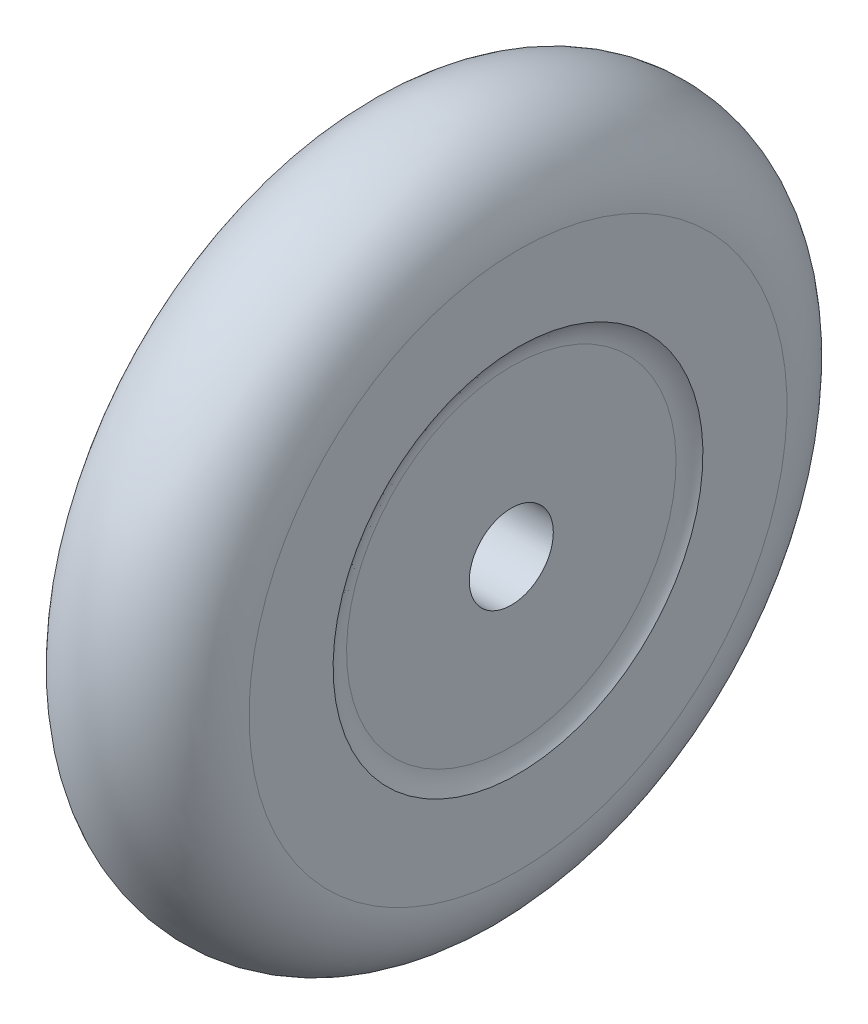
ISO-10303-21;
HEADER;
FILE_DESCRIPTION(('STEP AP214'),'2;1');
FILE_NAME('part.step','',(''),(''),'','','');
FILE_SCHEMA(('AUTOMOTIVE_DESIGN { 1 0 10303 214 1 1 1 1 }'));
ENDSEC;
DATA;
#1=APPLICATION_CONTEXT('core data for automotive mechanical design processes');
#2=APPLICATION_PROTOCOL_DEFINITION('international standard','automotive_design',2000,#1);
#3=PRODUCT_CONTEXT('',#1,'mechanical');
#4=PRODUCT('Part','Part','',(#3));
#5=PRODUCT_RELATED_PRODUCT_CATEGORY('part','',(#4));
#6=PRODUCT_DEFINITION_FORMATION('','',#4);
#7=PRODUCT_DEFINITION_CONTEXT('part definition',#1,'design');
#8=PRODUCT_DEFINITION('design','',#6,#7);
#9=PRODUCT_DEFINITION_SHAPE('','',#8);
#10=(LENGTH_UNIT() NAMED_UNIT(*) SI_UNIT(.MILLI.,.METRE.));
#11=(NAMED_UNIT(*) PLANE_ANGLE_UNIT() SI_UNIT($,.RADIAN.));
#12=(NAMED_UNIT(*) SI_UNIT($,.STERADIAN.) SOLID_ANGLE_UNIT());
#13=UNCERTAINTY_MEASURE_WITH_UNIT(LENGTH_MEASURE(1.E-05),#10,'distance_accuracy_value','');
#14=(GEOMETRIC_REPRESENTATION_CONTEXT(3) GLOBAL_UNCERTAINTY_ASSIGNED_CONTEXT((#13)) GLOBAL_UNIT_ASSIGNED_CONTEXT((#10,
#11,#12)) REPRESENTATION_CONTEXT('',''));
#15=CARTESIAN_POINT('',(0.,0.,0.));
#16=DIRECTION('',(0.,0.,1.));
#17=DIRECTION('',(1.,0.,0.));
#18=AXIS2_PLACEMENT_3D('',#15,#16,#17);
#19=CARTESIAN_POINT('',(12.7,0.,0.));
#20=DIRECTION('',(-1.,0.,0.));
#21=DIRECTION('',(0.,0.,1.));
#22=AXIS2_PLACEMENT_3D('',#19,#20,#21);
#23=CYLINDRICAL_SURFACE('',#22,3.175);
#24=CARTESIAN_POINT('',(0.508,0.,0.));
#25=DIRECTION('',(-1.,0.,0.));
#26=DIRECTION('',(0.,-1.,0.));
#27=AXIS2_PLACEMENT_3D('',#24,#25,#26);
#28=CIRCLE('',#27,3.175);
#29=CARTESIAN_POINT('',(0.508000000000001,-3.175,0.));
#30=VERTEX_POINT('',#29);
#31=EDGE_CURVE('E60',#30,#30,#28,.F.);
#32=ORIENTED_EDGE('',*,*,#31,.F.);
#33=EDGE_LOOP('',(#32));
#34=FACE_BOUND('',#33,.T.);
#35=CARTESIAN_POINT('',(12.192,0.,0.));
#36=DIRECTION('',(1.,0.,0.));
#37=DIRECTION('',(0.,1.,0.));
#38=AXIS2_PLACEMENT_3D('',#35,#36,#37);
#39=CIRCLE('',#38,3.175);
#40=CARTESIAN_POINT('',(12.192,3.175,0.));
#41=VERTEX_POINT('',#40);
#42=EDGE_CURVE('E55',#41,#41,#39,.F.);
#43=ORIENTED_EDGE('',*,*,#42,.F.);
#44=EDGE_LOOP('',(#43));
#45=FACE_BOUND('',#44,.T.);
#46=ADVANCED_FACE('F37',(#34,#45),#23,.F.);
#47=CARTESIAN_POINT('',(6.35,0.,0.));
#48=DIRECTION('',(1.,0.,0.));
#49=DIRECTION('',(0.,1.,0.));
#50=AXIS2_PLACEMENT_3D('',#47,#48,#49);
#51=TOROIDAL_SURFACE('',#50,20.32,6.35);
#52=CARTESIAN_POINT('',(0.,0.,0.));
#53=DIRECTION('',(1.,0.,0.));
#54=DIRECTION('',(0.,1.,0.));
#55=AXIS2_PLACEMENT_3D('',#52,#53,#54);
#56=CIRCLE('',#55,20.32);
#57=CARTESIAN_POINT('',(0.,20.32,0.));
#58=VERTEX_POINT('',#57);
#59=EDGE_CURVE('E52',#58,#58,#56,.T.);
#60=ORIENTED_EDGE('',*,*,#59,.T.);
#61=EDGE_LOOP('',(#60));
#62=FACE_BOUND('',#61,.T.);
#63=CARTESIAN_POINT('',(12.7,0.,0.));
#64=DIRECTION('',(1.,0.,0.));
#65=DIRECTION('',(0.,1.,0.));
#66=AXIS2_PLACEMENT_3D('',#63,#64,#65);
#67=CIRCLE('',#66,20.32);
#68=CARTESIAN_POINT('',(12.7,20.32,0.));
#69=VERTEX_POINT('',#68);
#70=EDGE_CURVE('E48',#69,#69,#67,.T.);
#71=ORIENTED_EDGE('',*,*,#70,.F.);
#72=EDGE_LOOP('',(#71));
#73=FACE_BOUND('',#72,.T.);
#74=ADVANCED_FACE('F76',(#62,#73),#51,.T.);
#75=CARTESIAN_POINT('',(12.7,20.32,0.));
#76=DIRECTION('',(1.,0.,0.));
#77=DIRECTION('',(0.,1.,0.));
#78=AXIS2_PLACEMENT_3D('',#75,#76,#77);
#79=PLANE('',#78);
#80=CARTESIAN_POINT('',(12.7,0.,0.));
#81=DIRECTION('',(1.,0.,0.));
#82=DIRECTION('',(0.,1.,0.));
#83=AXIS2_PLACEMENT_3D('',#80,#81,#82);
#84=CIRCLE('',#83,13.97);
#85=CARTESIAN_POINT('',(12.7,13.97,0.));
#86=VERTEX_POINT('',#85);
#87=EDGE_CURVE('E59',#86,#86,#84,.T.);
#88=ORIENTED_EDGE('',*,*,#87,.F.);
#89=EDGE_LOOP('',(#88));
#90=FACE_BOUND('',#89,.T.);
#91=ORIENTED_EDGE('',*,*,#70,.T.);
#92=EDGE_LOOP('',(#91));
#93=FACE_BOUND('',#92,.T.);
#94=ADVANCED_FACE('F72',(#90,#93),#79,.T.);
#95=CARTESIAN_POINT('',(0.,20.32,0.));
#96=DIRECTION('',(-1.,0.,0.));
#97=DIRECTION('',(0.,-1.,0.));
#98=AXIS2_PLACEMENT_3D('',#95,#96,#97);
#99=PLANE('',#98);
#100=CARTESIAN_POINT('',(0.,0.,0.));
#101=DIRECTION('',(-1.,0.,0.));
#102=DIRECTION('',(0.,-1.,0.));
#103=AXIS2_PLACEMENT_3D('',#100,#101,#102);
#104=CIRCLE('',#103,13.97);
#105=CARTESIAN_POINT('',(0.,-13.97,0.));
#106=VERTEX_POINT('',#105);
#107=EDGE_CURVE('E58',#106,#106,#104,.T.);
#108=ORIENTED_EDGE('',*,*,#107,.F.);
#109=EDGE_LOOP('',(#108));
#110=FACE_BOUND('',#109,.T.);
#111=ORIENTED_EDGE('',*,*,#59,.F.);
#112=EDGE_LOOP('',(#111));
#113=FACE_BOUND('',#112,.T.);
#114=ADVANCED_FACE('F75',(#110,#113),#99,.T.);
#115=CARTESIAN_POINT('',(0.508,0.,0.));
#116=DIRECTION('',(-1.,0.,0.));
#117=DIRECTION('',(0.,-1.,0.));
#118=AXIS2_PLACEMENT_3D('',#115,#116,#117);
#119=PLANE('',#118);
#120=CARTESIAN_POINT('',(0.508,0.,0.));
#121=DIRECTION('',(-1.,0.,0.));
#122=DIRECTION('',(0.,-1.,0.));
#123=AXIS2_PLACEMENT_3D('',#120,#121,#122);
#124=CIRCLE('',#123,12.446);
#125=CARTESIAN_POINT('',(0.508000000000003,-12.446,0.));
#126=VERTEX_POINT('',#125);
#127=EDGE_CURVE('E44',#126,#126,#124,.T.);
#128=ORIENTED_EDGE('',*,*,#127,.T.);
#129=EDGE_LOOP('',(#128));
#130=FACE_BOUND('',#129,.T.);
#131=ORIENTED_EDGE('',*,*,#31,.T.);
#132=EDGE_LOOP('',(#131));
#133=FACE_BOUND('',#132,.T.);
#134=ADVANCED_FACE('F97',(#130,#133),#119,.T.);
#135=CARTESIAN_POINT('',(12.192,0.,0.));
#136=DIRECTION('',(1.,0.,0.));
#137=DIRECTION('',(0.,1.,0.));
#138=AXIS2_PLACEMENT_3D('',#135,#136,#137);
#139=PLANE('',#138);
#140=CARTESIAN_POINT('',(12.192,0.,0.));
#141=DIRECTION('',(1.,0.,0.));
#142=DIRECTION('',(0.,1.,0.));
#143=AXIS2_PLACEMENT_3D('',#140,#141,#142);
#144=CIRCLE('',#143,12.446);
#145=CARTESIAN_POINT('',(12.192,12.446,0.));
#146=VERTEX_POINT('',#145);
#147=EDGE_CURVE('E10',#146,#146,#144,.T.);
#148=ORIENTED_EDGE('',*,*,#147,.T.);
#149=EDGE_LOOP('',(#148));
#150=FACE_BOUND('',#149,.T.);
#151=ORIENTED_EDGE('',*,*,#42,.T.);
#152=EDGE_LOOP('',(#151));
#153=FACE_BOUND('',#152,.T.);
#154=ADVANCED_FACE('F91',(#150,#153),#139,.T.);
#155=CARTESIAN_POINT('',(-2.032,0.,0.));
#156=DIRECTION('',(1.,0.,0.));
#157=DIRECTION('',(0.,1.,0.));
#158=AXIS2_PLACEMENT_3D('',#155,#156,#157);
#159=TOROIDAL_SURFACE('',#158,12.446,2.54);
#160=ORIENTED_EDGE('',*,*,#107,.T.);
#161=EDGE_LOOP('',(#160));
#162=FACE_BOUND('',#161,.T.);
#163=ORIENTED_EDGE('',*,*,#127,.F.);
#164=EDGE_LOOP('',(#163));
#165=FACE_BOUND('',#164,.T.);
#166=ADVANCED_FACE('F89',(#162,#165),#159,.F.);
#167=CARTESIAN_POINT('',(14.732,0.,0.));
#168=DIRECTION('',(-1.,0.,0.));
#169=DIRECTION('',(0.,-1.,0.));
#170=AXIS2_PLACEMENT_3D('',#167,#168,#169);
#171=TOROIDAL_SURFACE('',#170,12.446,2.54);
#172=ORIENTED_EDGE('',*,*,#87,.T.);
#173=EDGE_LOOP('',(#172));
#174=FACE_BOUND('',#173,.T.);
#175=ORIENTED_EDGE('',*,*,#147,.F.);
#176=EDGE_LOOP('',(#175));
#177=FACE_BOUND('',#176,.T.);
#178=ADVANCED_FACE('F39',(#174,#177),#171,.F.);
#179=CLOSED_SHELL('',(#46,#74,#94,#114,#134,#154,#166,#178));
#180=MANIFOLD_SOLID_BREP('B2',#179);
#181=ADVANCED_BREP_SHAPE_REPRESENTATION('',(#18,#180),#14);
#182=SHAPE_DEFINITION_REPRESENTATION(#9,#181);
ENDSEC;
END-ISO-10303-21;
